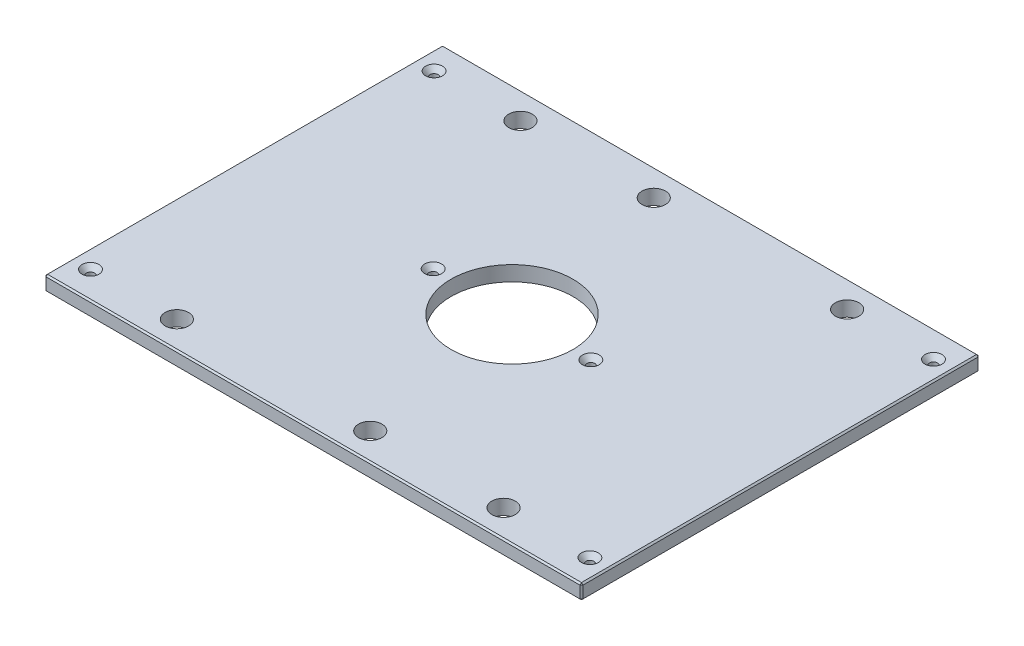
from build123d import *

# Parameters (mm, degrees)
SKETCH1_W                                        = 454.025
SKETCH1_H                                        = 336.55
BOSS_EXTRUDE1_DEPTH                              = 12.7
SKETCH13_R                                       = 51.562
CUT_EXTRUDE6_DEPTH                               = 283.864704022
F_25_32_0_78125_DIAMETER_HOLE1_D                 = 19.84375
CHAMFER2_SIZE                                    = 1.27
CSK_FOR_1_4_FLAT_HEAD_MACHINE_SCREW1_D           = 6.7564
CSK_FOR_1_4_FLAT_HEAD_MACHINE_SCREW1_CSINK_D     = 14.2748
CSK_FOR_1_4_FLAT_HEAD_MACHINE_SCREW1_CSINK_ANGLE = 82


with BuildPart() as part:
    # Sketch1 → Boss-Extrude1 (new body)
    with BuildSketch(Plane(origin=(0, 0, 0), x_dir=(1, 0, 0), z_dir=(0, 1, 0))):
        Rectangle(SKETCH1_W, SKETCH1_H)
    extrude(amount=BOSS_EXTRUDE1_DEPTH)

    # Sketch13 → Cut-Extrude6 (cut, through all)
    with BuildSketch(Plane(origin=(0, 12.7, 0), x_dir=(1, 0, 0), z_dir=(0, 1, 0))):
        with Locations(Location((0, 0, 0), (0, 0, 270))):
            Circle(SKETCH13_R)
    extrude(amount=-CUT_EXTRUDE6_DEPTH, mode=Mode.SUBTRACT)

    # 25_32 _0.78125_ Diameter Hole1 (through all)
    with Locations(Plane(origin=(0, 12.7, 0), x_dir=(1, 0, 0), z_dir=(0, 1, 0))):
        with Locations((138.1125, 145.25498), (-138.1125, 145.25498), (138.1125, -145.25498), (-138.1125, -145.25498), (-25.4, 145.25498), (25.4, -145.25498)):
            Hole(F_25_32_0_78125_DIAMETER_HOLE1_D / 2)

    # Chamfer2
    chamfer2_edges = [part.edges().sort_by_distance(p)[0] for p in [
        (227.0125, 12.7, 0),
        (0, 12.7, -168.275),
        (-227.0125, 12.7, 0),
        (0, 0, -168.275),
        (227.0125, 0, 0),
        (0, 0, 168.275),
        (-227.0125, 0, 0),
        (0, 12.7, 168.275),
        (-227.0125, 6.35, -168.275),
        (227.0125, 6.35, -168.275),
        (227.0125, 6.35, 168.275),
        (-227.0125, 6.35, 168.275),
    ]]
    chamfer(chamfer2_edges, length=CHAMFER2_SIZE)

    # CSK for 1_4 Flat Head Machine Screw1 (through all)
    with Locations(Plane(origin=(0, 12.7, 0), x_dir=(1, 0, 0), z_dir=(0, 1, 0))):
        with Locations((211.1375, 145.25498), (211.1375, -145.25498), (-211.1375, -145.25498), (-66.675, 0), (66.675, 0), (-211.1375, 145.25498), (-138.1125, 145.25498), (-138.1125, -145.25498)):
            CounterSinkHole(CSK_FOR_1_4_FLAT_HEAD_MACHINE_SCREW1_D / 2, CSK_FOR_1_4_FLAT_HEAD_MACHINE_SCREW1_CSINK_D / 2, counter_sink_angle=CSK_FOR_1_4_FLAT_HEAD_MACHINE_SCREW1_CSINK_ANGLE)


solid = part.part
